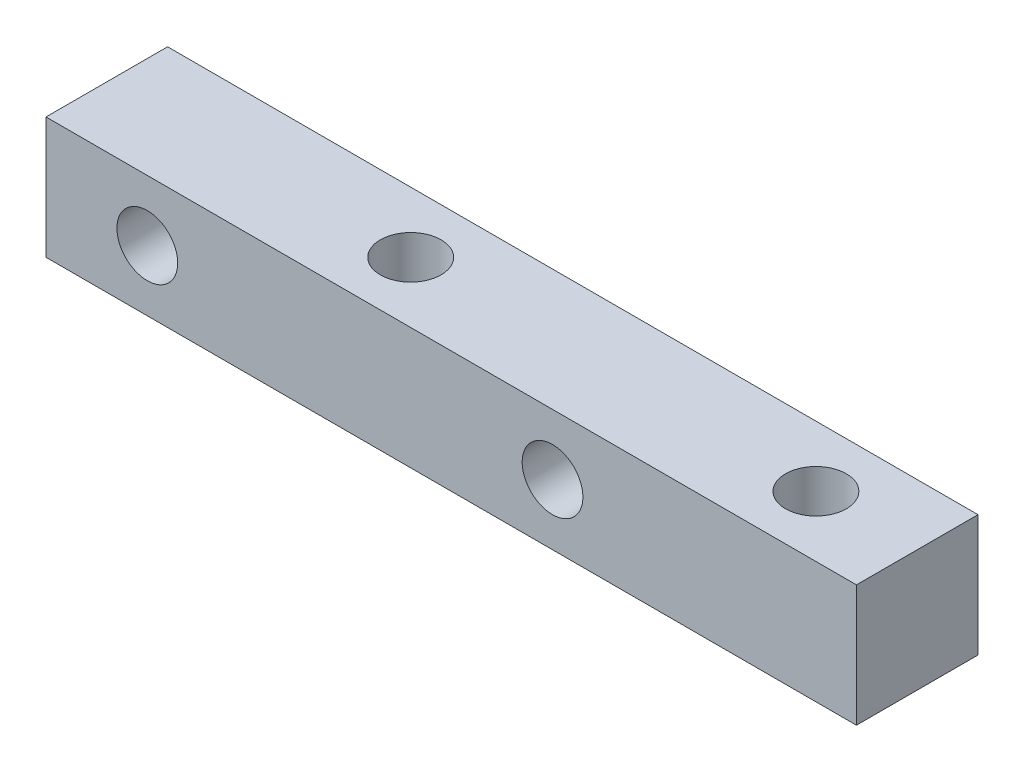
from build123d import *

# Parameters (mm, degrees)
SKETCH_1_W          = 40
SKETCH_1_H          = 6
EXTRUDE_1_DEPTH     = 6
SKETCH_2_R          = 1.5
CUT_EXTRUDE_1_DEPTH = 22.09502311
SKETCH_3_R          = 1.5
CUT_EXTRUDE_2_DEPTH = 22.725560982


with BuildPart() as part:
    # Sketch 1 → Extrude 1 (new body)
    with BuildSketch(Plane(origin=(0, 0, 0), x_dir=(1, 0, 0), z_dir=(0, 1, 0))):
        Rectangle(SKETCH_1_W, SKETCH_1_H)
    extrude(amount=EXTRUDE_1_DEPTH)

    # Sketch 2 → Cut-Extrude 1 (cut, through all)
    with BuildSketch(Plane(origin=(0, 6, 0), x_dir=(1, 0, 0), z_dir=(0, 1, 0))):
        with Locations(Location((15, 0, 0), (0, 0, 270))):
            Circle(SKETCH_2_R)
        with Locations(Location((-5, 0, 0), (0, 0, 270))):
            Circle(SKETCH_2_R)
    extrude(amount=-CUT_EXTRUDE_1_DEPTH, mode=Mode.SUBTRACT)

    # Sketch 3 → Cut-Extrude 2 (cut, through all)
    with BuildSketch(Plane(origin=(0, 0, -3), x_dir=(-1, 0, 0), z_dir=(0, 0, -1))):
        with Locations((15, 3)):
            Circle(SKETCH_3_R)
        with Locations((-5, 3)):
            Circle(SKETCH_3_R)
    extrude(amount=-CUT_EXTRUDE_2_DEPTH, mode=Mode.SUBTRACT)


solid = part.part
